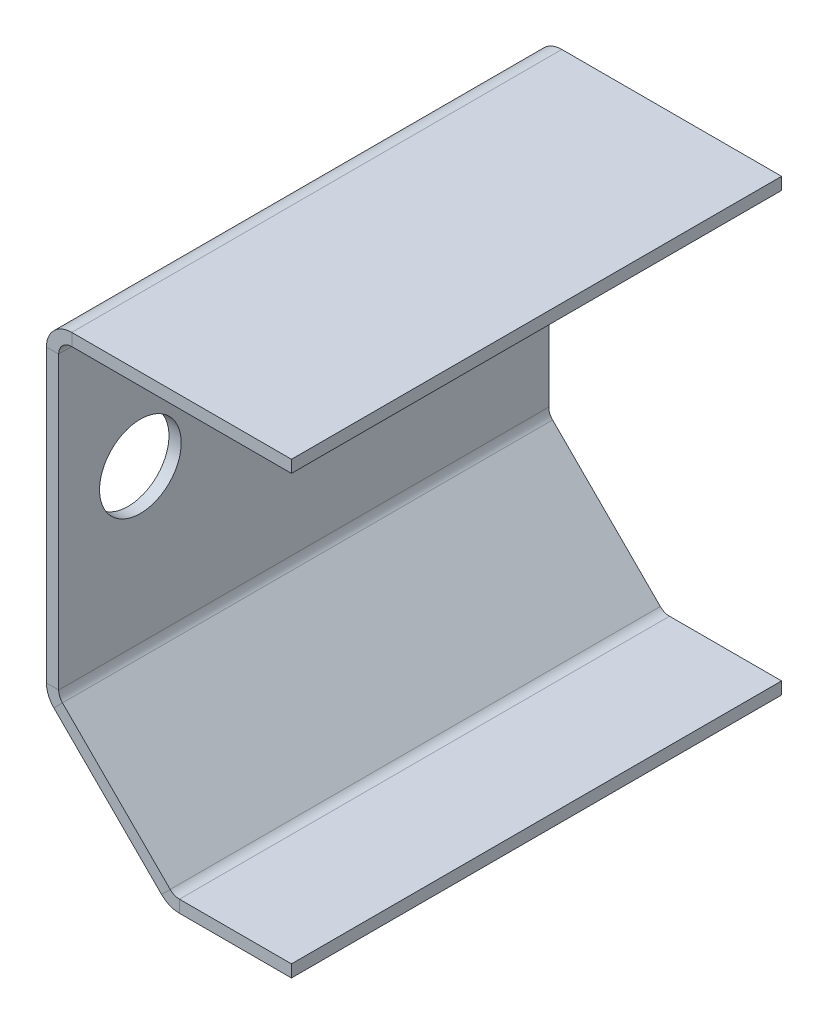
ISO-10303-21;
HEADER;
FILE_DESCRIPTION(('STEP AP214'),'2;1');
FILE_NAME('part.step','',(''),(''),'','','');
FILE_SCHEMA(('AUTOMOTIVE_DESIGN { 1 0 10303 214 1 1 1 1 }'));
ENDSEC;
DATA;
#1=APPLICATION_CONTEXT('core data for automotive mechanical design processes');
#2=APPLICATION_PROTOCOL_DEFINITION('international standard','automotive_design',2000,#1);
#3=PRODUCT_CONTEXT('',#1,'mechanical');
#4=PRODUCT('Part','Part','',(#3));
#5=PRODUCT_RELATED_PRODUCT_CATEGORY('part','',(#4));
#6=PRODUCT_DEFINITION_FORMATION('','',#4);
#7=PRODUCT_DEFINITION_CONTEXT('part definition',#1,'design');
#8=PRODUCT_DEFINITION('design','',#6,#7);
#9=PRODUCT_DEFINITION_SHAPE('','',#8);
#10=(LENGTH_UNIT() NAMED_UNIT(*) SI_UNIT(.MILLI.,.METRE.));
#11=(NAMED_UNIT(*) PLANE_ANGLE_UNIT() SI_UNIT($,.RADIAN.));
#12=(NAMED_UNIT(*) SI_UNIT($,.STERADIAN.) SOLID_ANGLE_UNIT());
#13=UNCERTAINTY_MEASURE_WITH_UNIT(LENGTH_MEASURE(1.E-05),#10,'distance_accuracy_value','');
#14=(GEOMETRIC_REPRESENTATION_CONTEXT(3) GLOBAL_UNCERTAINTY_ASSIGNED_CONTEXT((#13)) GLOBAL_UNIT_ASSIGNED_CONTEXT((#10,
#11,#12)) REPRESENTATION_CONTEXT('',''));
#15=CARTESIAN_POINT('',(0.,0.,0.));
#16=DIRECTION('',(0.,0.,1.));
#17=DIRECTION('',(1.,0.,0.));
#18=AXIS2_PLACEMENT_3D('',#15,#16,#17);
#19=CARTESIAN_POINT('',(-21.9,-3.7159379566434,60.));
#20=DIRECTION('',(0.,0.,1.));
#21=DIRECTION('',(1.,0.,0.));
#22=AXIS2_PLACEMENT_3D('',#19,#20,#21);
#23=PLANE('',#22);
#24=DIRECTION('',(-0.707106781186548,-0.707106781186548,0.));
#25=VECTOR('',#24,1.);
#26=CARTESIAN_POINT('',(-24.0920310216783,-5.9079689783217,60.));
#27=LINE('',#26,#25);
#28=CARTESIAN_POINT('',(-23.0313708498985,-4.84730880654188,60.));
#29=VERTEX_POINT('',#28);
#30=CARTESIAN_POINT('',(-24.0920310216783,-5.9079689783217,60.));
#31=VERTEX_POINT('',#30);
#32=EDGE_CURVE('E13',#29,#31,#27,.T.);
#33=ORIENTED_EDGE('',*,*,#32,.F.);
#34=CARTESIAN_POINT('',(-21.9,-3.7159379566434,60.));
#35=DIRECTION('',(0.,0.,-1.));
#36=DIRECTION('',(-1.,0.,0.));
#37=AXIS2_PLACEMENT_3D('',#34,#35,#36);
#38=CIRCLE('',#37,1.6);
#39=CARTESIAN_POINT('',(-23.5,-3.7159379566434,60.));
#40=VERTEX_POINT('',#39);
#41=EDGE_CURVE('E189',#40,#29,#38,.F.);
#42=ORIENTED_EDGE('',*,*,#41,.F.);
#43=DIRECTION('',(-1.,0.,0.));
#44=VECTOR('',#43,1.);
#45=CARTESIAN_POINT('',(-25.,-3.7159379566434,60.));
#46=LINE('',#45,#44);
#47=CARTESIAN_POINT('',(-25.,-3.7159379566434,60.));
#48=VERTEX_POINT('',#47);
#49=EDGE_CURVE('E63',#40,#48,#46,.T.);
#50=ORIENTED_EDGE('',*,*,#49,.T.);
#51=CARTESIAN_POINT('',(-21.9,-3.7159379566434,60.));
#52=DIRECTION('',(0.,0.,-1.));
#53=DIRECTION('',(-1.,0.,0.));
#54=AXIS2_PLACEMENT_3D('',#51,#52,#53);
#55=CIRCLE('',#54,3.1);
#56=EDGE_CURVE('E257',#48,#31,#55,.F.);
#57=ORIENTED_EDGE('',*,*,#56,.T.);
#58=EDGE_LOOP('',(#33,#42,#50,#57));
#59=FACE_BOUND('',#58,.T.);
#60=ADVANCED_FACE('F53',(#59),#23,.T.);
#61=CARTESIAN_POINT('',(-25.,-5.,60.));
#62=DIRECTION('',(0.,0.,1.));
#63=DIRECTION('',(0.,1.,0.));
#64=AXIS2_PLACEMENT_3D('',#61,#62,#63);
#65=PLANE('',#64);
#66=ORIENTED_EDGE('',*,*,#49,.F.);
#67=DIRECTION('',(0.,1.,0.));
#68=VECTOR('',#67,1.);
#69=CARTESIAN_POINT('',(-23.5,-5.,60.));
#70=LINE('',#69,#68);
#71=CARTESIAN_POINT('',(-23.5,31.9,60.));
#72=VERTEX_POINT('',#71);
#73=EDGE_CURVE('E210',#40,#72,#70,.T.);
#74=ORIENTED_EDGE('',*,*,#73,.T.);
#75=DIRECTION('',(-1.,0.,0.));
#76=VECTOR('',#75,1.);
#77=CARTESIAN_POINT('',(-25.,31.9,60.));
#78=LINE('',#77,#76);
#79=CARTESIAN_POINT('',(-25.,31.9,60.));
#80=VERTEX_POINT('',#79);
#81=EDGE_CURVE('E250',#72,#80,#78,.T.);
#82=ORIENTED_EDGE('',*,*,#81,.T.);
#83=DIRECTION('',(0.,1.,0.));
#84=VECTOR('',#83,1.);
#85=CARTESIAN_POINT('',(-25.,-5.,60.));
#86=LINE('',#85,#84);
#87=EDGE_CURVE('E276',#48,#80,#86,.T.);
#88=ORIENTED_EDGE('',*,*,#87,.F.);
#89=EDGE_LOOP('',(#66,#74,#82,#88));
#90=FACE_BOUND('',#89,.T.);
#91=ADVANCED_FACE('F277',(#90),#65,.T.);
#92=CARTESIAN_POINT('',(-21.9,31.9,60.));
#93=DIRECTION('',(0.,0.,1.));
#94=DIRECTION('',(1.,0.,0.));
#95=AXIS2_PLACEMENT_3D('',#92,#93,#94);
#96=PLANE('',#95);
#97=ORIENTED_EDGE('',*,*,#81,.F.);
#98=CARTESIAN_POINT('',(-21.9,31.9,60.));
#99=DIRECTION('',(0.,0.,-1.));
#100=DIRECTION('',(-1.,0.,0.));
#101=AXIS2_PLACEMENT_3D('',#98,#99,#100);
#102=CIRCLE('',#101,1.6);
#103=CARTESIAN_POINT('',(-21.9,33.5,60.));
#104=VERTEX_POINT('',#103);
#105=EDGE_CURVE('E197',#104,#72,#102,.F.);
#106=ORIENTED_EDGE('',*,*,#105,.F.);
#107=DIRECTION('',(0.,1.,0.));
#108=VECTOR('',#107,1.);
#109=CARTESIAN_POINT('',(-21.9,35.,60.));
#110=LINE('',#109,#108);
#111=CARTESIAN_POINT('',(-21.9,35.,60.));
#112=VERTEX_POINT('',#111);
#113=EDGE_CURVE('E247',#104,#112,#110,.T.);
#114=ORIENTED_EDGE('',*,*,#113,.T.);
#115=CARTESIAN_POINT('',(-21.9,31.9,60.));
#116=DIRECTION('',(0.,0.,-1.));
#117=DIRECTION('',(-1.,0.,0.));
#118=AXIS2_PLACEMENT_3D('',#115,#116,#117);
#119=CIRCLE('',#118,3.1);
#120=EDGE_CURVE('E290',#112,#80,#119,.F.);
#121=ORIENTED_EDGE('',*,*,#120,.T.);
#122=EDGE_LOOP('',(#97,#106,#114,#121));
#123=FACE_BOUND('',#122,.T.);
#124=ADVANCED_FACE('F353',(#123),#96,.T.);
#125=CARTESIAN_POINT('',(-25.,35.,60.));
#126=DIRECTION('',(0.,0.,1.));
#127=DIRECTION('',(1.,0.,0.));
#128=AXIS2_PLACEMENT_3D('',#125,#126,#127);
#129=PLANE('',#128);
#130=ORIENTED_EDGE('',*,*,#113,.F.);
#131=DIRECTION('',(1.,0.,0.));
#132=VECTOR('',#131,1.);
#133=CARTESIAN_POINT('',(-25.,33.5,60.));
#134=LINE('',#133,#132);
#135=CARTESIAN_POINT('',(5.,33.5,60.));
#136=VERTEX_POINT('',#135);
#137=EDGE_CURVE('E205',#104,#136,#134,.T.);
#138=ORIENTED_EDGE('',*,*,#137,.T.);
#139=DIRECTION('',(0.,1.,0.));
#140=VECTOR('',#139,1.);
#141=CARTESIAN_POINT('',(5.,35.,60.));
#142=LINE('',#141,#140);
#143=CARTESIAN_POINT('',(5.,35.,60.));
#144=VERTEX_POINT('',#143);
#145=EDGE_CURVE('E244',#136,#144,#142,.T.);
#146=ORIENTED_EDGE('',*,*,#145,.T.);
#147=DIRECTION('',(1.,0.,0.));
#148=VECTOR('',#147,1.);
#149=CARTESIAN_POINT('',(-25.,35.,60.));
#150=LINE('',#149,#148);
#151=EDGE_CURVE('E371',#112,#144,#150,.T.);
#152=ORIENTED_EDGE('',*,*,#151,.F.);
#153=EDGE_LOOP('',(#130,#138,#146,#152));
#154=FACE_BOUND('',#153,.T.);
#155=ADVANCED_FACE('F723',(#154),#129,.T.);
#156=CARTESIAN_POINT('',(5.,35.,60.));
#157=DIRECTION('',(1.,0.,0.));
#158=DIRECTION('',(0.,0.,-1.));
#159=AXIS2_PLACEMENT_3D('',#156,#157,#158);
#160=PLANE('',#159);
#161=ORIENTED_EDGE('',*,*,#145,.F.);
#162=DIRECTION('',(0.,0.,1.));
#163=VECTOR('',#162,1.);
#164=CARTESIAN_POINT('',(5.,33.5,60.));
#165=LINE('',#164,#163);
#166=CARTESIAN_POINT('',(5.,33.5,0.));
#167=VERTEX_POINT('',#166);
#168=EDGE_CURVE('E201',#136,#167,#165,.F.);
#169=ORIENTED_EDGE('',*,*,#168,.T.);
#170=DIRECTION('',(0.,1.,0.));
#171=VECTOR('',#170,1.);
#172=CARTESIAN_POINT('',(5.,35.,0.));
#173=LINE('',#172,#171);
#174=CARTESIAN_POINT('',(5.,35.,0.));
#175=VERTEX_POINT('',#174);
#176=EDGE_CURVE('E241',#167,#175,#173,.T.);
#177=ORIENTED_EDGE('',*,*,#176,.T.);
#178=DIRECTION('',(0.,0.,-1.));
#179=VECTOR('',#178,1.);
#180=CARTESIAN_POINT('',(5.,35.,60.));
#181=LINE('',#180,#179);
#182=EDGE_CURVE('E368',#144,#175,#181,.T.);
#183=ORIENTED_EDGE('',*,*,#182,.F.);
#184=EDGE_LOOP('',(#161,#169,#177,#183));
#185=FACE_BOUND('',#184,.T.);
#186=ADVANCED_FACE('F712',(#185),#160,.T.);
#187=CARTESIAN_POINT('',(-25.,35.,0.));
#188=DIRECTION('',(0.,0.,1.));
#189=DIRECTION('',(1.,0.,0.));
#190=AXIS2_PLACEMENT_3D('',#187,#188,#189);
#191=PLANE('',#190);
#192=ORIENTED_EDGE('',*,*,#176,.F.);
#193=DIRECTION('',(1.,0.,0.));
#194=VECTOR('',#193,1.);
#195=CARTESIAN_POINT('',(-25.,33.5,0.));
#196=LINE('',#195,#194);
#197=CARTESIAN_POINT('',(-21.9,33.5,0.));
#198=VERTEX_POINT('',#197);
#199=EDGE_CURVE('E198',#198,#167,#196,.T.);
#200=ORIENTED_EDGE('',*,*,#199,.F.);
#201=DIRECTION('',(0.,1.,0.));
#202=VECTOR('',#201,1.);
#203=CARTESIAN_POINT('',(-21.9,35.,0.));
#204=LINE('',#203,#202);
#205=CARTESIAN_POINT('',(-21.9,35.,0.));
#206=VERTEX_POINT('',#205);
#207=EDGE_CURVE('E238',#198,#206,#204,.T.);
#208=ORIENTED_EDGE('',*,*,#207,.T.);
#209=DIRECTION('',(1.,0.,0.));
#210=VECTOR('',#209,1.);
#211=CARTESIAN_POINT('',(-25.,35.,0.));
#212=LINE('',#211,#210);
#213=EDGE_CURVE('E170',#206,#175,#212,.T.);
#214=ORIENTED_EDGE('',*,*,#213,.T.);
#215=EDGE_LOOP('',(#192,#200,#208,#214));
#216=FACE_BOUND('',#215,.T.);
#217=ADVANCED_FACE('F377',(#216),#191,.F.);
#218=CARTESIAN_POINT('',(-21.9,31.9,0.));
#219=DIRECTION('',(0.,0.,1.));
#220=DIRECTION('',(1.,0.,0.));
#221=AXIS2_PLACEMENT_3D('',#218,#219,#220);
#222=PLANE('',#221);
#223=ORIENTED_EDGE('',*,*,#207,.F.);
#224=CARTESIAN_POINT('',(-21.9,31.9,0.));
#225=DIRECTION('',(0.,0.,-1.));
#226=DIRECTION('',(-1.,0.,0.));
#227=AXIS2_PLACEMENT_3D('',#224,#225,#226);
#228=CIRCLE('',#227,1.6);
#229=CARTESIAN_POINT('',(-23.5,31.9,0.));
#230=VERTEX_POINT('',#229);
#231=EDGE_CURVE('E186',#230,#198,#228,.T.);
#232=ORIENTED_EDGE('',*,*,#231,.F.);
#233=DIRECTION('',(-1.,0.,0.));
#234=VECTOR('',#233,1.);
#235=CARTESIAN_POINT('',(-25.,31.9,0.));
#236=LINE('',#235,#234);
#237=CARTESIAN_POINT('',(-25.,31.9,0.));
#238=VERTEX_POINT('',#237);
#239=EDGE_CURVE('E235',#230,#238,#236,.T.);
#240=ORIENTED_EDGE('',*,*,#239,.T.);
#241=CARTESIAN_POINT('',(-21.9,31.9,0.));
#242=DIRECTION('',(0.,0.,-1.));
#243=DIRECTION('',(-1.,0.,0.));
#244=AXIS2_PLACEMENT_3D('',#241,#242,#243);
#245=CIRCLE('',#244,3.1);
#246=EDGE_CURVE('E292',#238,#206,#245,.T.);
#247=ORIENTED_EDGE('',*,*,#246,.T.);
#248=EDGE_LOOP('',(#223,#232,#240,#247));
#249=FACE_BOUND('',#248,.T.);
#250=ADVANCED_FACE('F339',(#249),#222,.F.);
#251=CARTESIAN_POINT('',(-25.,-5.,0.));
#252=DIRECTION('',(0.,0.,1.));
#253=DIRECTION('',(0.,1.,0.));
#254=AXIS2_PLACEMENT_3D('',#251,#252,#253);
#255=PLANE('',#254);
#256=ORIENTED_EDGE('',*,*,#239,.F.);
#257=DIRECTION('',(0.,1.,0.));
#258=VECTOR('',#257,1.);
#259=CARTESIAN_POINT('',(-23.5,-5.,0.));
#260=LINE('',#259,#258);
#261=CARTESIAN_POINT('',(-23.5,-3.7159379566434,0.));
#262=VERTEX_POINT('',#261);
#263=EDGE_CURVE('E190',#262,#230,#260,.T.);
#264=ORIENTED_EDGE('',*,*,#263,.F.);
#265=DIRECTION('',(-1.,0.,0.));
#266=VECTOR('',#265,1.);
#267=CARTESIAN_POINT('',(-25.,-3.7159379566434,0.));
#268=LINE('',#267,#266);
#269=CARTESIAN_POINT('',(-25.,-3.7159379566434,0.));
#270=VERTEX_POINT('',#269);
#271=EDGE_CURVE('E232',#262,#270,#268,.T.);
#272=ORIENTED_EDGE('',*,*,#271,.T.);
#273=DIRECTION('',(0.,1.,0.));
#274=VECTOR('',#273,1.);
#275=CARTESIAN_POINT('',(-25.,-5.,0.));
#276=LINE('',#275,#274);
#277=EDGE_CURVE('E288',#270,#238,#276,.T.);
#278=ORIENTED_EDGE('',*,*,#277,.T.);
#279=EDGE_LOOP('',(#256,#264,#272,#278));
#280=FACE_BOUND('',#279,.T.);
#281=ADVANCED_FACE('F680',(#280),#255,.F.);
#282=CARTESIAN_POINT('',(-21.9,-3.7159379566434,0.));
#283=DIRECTION('',(0.,0.,1.));
#284=DIRECTION('',(1.,0.,0.));
#285=AXIS2_PLACEMENT_3D('',#282,#283,#284);
#286=PLANE('',#285);
#287=ORIENTED_EDGE('',*,*,#271,.F.);
#288=CARTESIAN_POINT('',(-21.9,-3.7159379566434,0.));
#289=DIRECTION('',(0.,0.,-1.));
#290=DIRECTION('',(-1.,0.,0.));
#291=AXIS2_PLACEMENT_3D('',#288,#289,#290);
#292=CIRCLE('',#291,1.6);
#293=CARTESIAN_POINT('',(-23.0313708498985,-4.84730880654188,0.));
#294=VERTEX_POINT('',#293);
#295=EDGE_CURVE('E181',#294,#262,#292,.T.);
#296=ORIENTED_EDGE('',*,*,#295,.F.);
#297=DIRECTION('',(-0.707106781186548,-0.707106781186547,0.));
#298=VECTOR('',#297,1.);
#299=CARTESIAN_POINT('',(-24.0920310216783,-5.9079689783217,0.));
#300=LINE('',#299,#298);
#301=CARTESIAN_POINT('',(-24.0920310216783,-5.9079689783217,0.));
#302=VERTEX_POINT('',#301);
#303=EDGE_CURVE('E229',#294,#302,#300,.T.);
#304=ORIENTED_EDGE('',*,*,#303,.T.);
#305=CARTESIAN_POINT('',(-21.9,-3.7159379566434,0.));
#306=DIRECTION('',(0.,0.,-1.));
#307=DIRECTION('',(-1.,0.,0.));
#308=AXIS2_PLACEMENT_3D('',#305,#306,#307);
#309=CIRCLE('',#308,3.1);
#310=EDGE_CURVE('E273',#302,#270,#309,.T.);
#311=ORIENTED_EDGE('',*,*,#310,.T.);
#312=EDGE_LOOP('',(#287,#296,#304,#311));
#313=FACE_BOUND('',#312,.T.);
#314=ADVANCED_FACE('F668',(#313),#286,.F.);
#315=CARTESIAN_POINT('',(-10.,-20.,0.));
#316=DIRECTION('',(0.,0.,1.));
#317=DIRECTION('',(-0.707106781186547,0.707106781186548,0.));
#318=AXIS2_PLACEMENT_3D('',#315,#316,#317);
#319=PLANE('',#318);
#320=ORIENTED_EDGE('',*,*,#303,.F.);
#321=DIRECTION('',(0.707106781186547,-0.707106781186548,0.));
#322=VECTOR('',#321,1.);
#323=CARTESIAN_POINT('',(-8.93933982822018,-18.9393398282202,0.));
#324=LINE('',#323,#322);
#325=CARTESIAN_POINT('',(-9.84730880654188,-18.0313708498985,0.));
#326=VERTEX_POINT('',#325);
#327=EDGE_CURVE('E158',#326,#294,#324,.F.);
#328=ORIENTED_EDGE('',*,*,#327,.F.);
#329=DIRECTION('',(-0.707106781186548,-0.707106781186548,0.));
#330=VECTOR('',#329,1.);
#331=CARTESIAN_POINT('',(-10.9079689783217,-19.0920310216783,0.));
#332=LINE('',#331,#330);
#333=CARTESIAN_POINT('',(-10.9079689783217,-19.0920310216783,0.));
#334=VERTEX_POINT('',#333);
#335=EDGE_CURVE('E226',#326,#334,#332,.T.);
#336=ORIENTED_EDGE('',*,*,#335,.T.);
#337=DIRECTION('',(-0.707106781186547,0.707106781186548,0.));
#338=VECTOR('',#337,1.);
#339=CARTESIAN_POINT('',(-10.,-20.,0.));
#340=LINE('',#339,#338);
#341=EDGE_CURVE('E299',#334,#302,#340,.T.);
#342=ORIENTED_EDGE('',*,*,#341,.T.);
#343=EDGE_LOOP('',(#320,#328,#336,#342));
#344=FACE_BOUND('',#343,.T.);
#345=ADVANCED_FACE('F657',(#344),#319,.F.);
#346=CARTESIAN_POINT('',(-8.7159379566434,-16.9,0.));
#347=DIRECTION('',(0.,0.,1.));
#348=DIRECTION('',(1.,0.,0.));
#349=AXIS2_PLACEMENT_3D('',#346,#347,#348);
#350=PLANE('',#349);
#351=ORIENTED_EDGE('',*,*,#335,.F.);
#352=CARTESIAN_POINT('',(-8.7159379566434,-16.9,0.));
#353=DIRECTION('',(0.,0.,-1.));
#354=DIRECTION('',(-1.,0.,0.));
#355=AXIS2_PLACEMENT_3D('',#352,#353,#354);
#356=CIRCLE('',#355,1.6);
#357=CARTESIAN_POINT('',(-8.7159379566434,-18.5,0.));
#358=VERTEX_POINT('',#357);
#359=EDGE_CURVE('E154',#358,#326,#356,.T.);
#360=ORIENTED_EDGE('',*,*,#359,.F.);
#361=DIRECTION('',(0.,-1.,0.));
#362=VECTOR('',#361,1.);
#363=CARTESIAN_POINT('',(-8.7159379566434,-20.,0.));
#364=LINE('',#363,#362);
#365=CARTESIAN_POINT('',(-8.7159379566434,-20.,0.));
#366=VERTEX_POINT('',#365);
#367=EDGE_CURVE('E223',#358,#366,#364,.T.);
#368=ORIENTED_EDGE('',*,*,#367,.T.);
#369=CARTESIAN_POINT('',(-8.7159379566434,-16.9,0.));
#370=DIRECTION('',(0.,0.,-1.));
#371=DIRECTION('',(-1.,0.,0.));
#372=AXIS2_PLACEMENT_3D('',#369,#370,#371);
#373=CIRCLE('',#372,3.1);
#374=EDGE_CURVE('E143',#366,#334,#373,.T.);
#375=ORIENTED_EDGE('',*,*,#374,.T.);
#376=EDGE_LOOP('',(#351,#360,#368,#375));
#377=FACE_BOUND('',#376,.T.);
#378=ADVANCED_FACE('F396',(#377),#350,.F.);
#379=CARTESIAN_POINT('',(5.,-20.,0.));
#380=DIRECTION('',(0.,0.,1.));
#381=DIRECTION('',(-1.,0.,0.));
#382=AXIS2_PLACEMENT_3D('',#379,#380,#381);
#383=PLANE('',#382);
#384=ORIENTED_EDGE('',*,*,#367,.F.);
#385=DIRECTION('',(1.,0.,0.));
#386=VECTOR('',#385,1.);
#387=CARTESIAN_POINT('',(5.,-18.5,0.));
#388=LINE('',#387,#386);
#389=CARTESIAN_POINT('',(5.,-18.5,0.));
#390=VERTEX_POINT('',#389);
#391=EDGE_CURVE('E173',#390,#358,#388,.F.);
#392=ORIENTED_EDGE('',*,*,#391,.F.);
#393=DIRECTION('',(0.,-1.,0.));
#394=VECTOR('',#393,1.);
#395=CARTESIAN_POINT('',(5.,-20.,0.));
#396=LINE('',#395,#394);
#397=CARTESIAN_POINT('',(5.,-20.,0.));
#398=VERTEX_POINT('',#397);
#399=EDGE_CURVE('E221',#390,#398,#396,.T.);
#400=ORIENTED_EDGE('',*,*,#399,.T.);
#401=DIRECTION('',(-1.,0.,0.));
#402=VECTOR('',#401,1.);
#403=CARTESIAN_POINT('',(5.,-20.,0.));
#404=LINE('',#403,#402);
#405=EDGE_CURVE('E313',#398,#366,#404,.T.);
#406=ORIENTED_EDGE('',*,*,#405,.T.);
#407=EDGE_LOOP('',(#384,#392,#400,#406));
#408=FACE_BOUND('',#407,.T.);
#409=ADVANCED_FACE('F402',(#408),#383,.F.);
#410=CARTESIAN_POINT('',(5.,-20.,60.));
#411=DIRECTION('',(-1.,0.,0.));
#412=DIRECTION('',(0.,0.,-1.));
#413=AXIS2_PLACEMENT_3D('',#410,#411,#412);
#414=PLANE('',#413);
#415=ORIENTED_EDGE('',*,*,#399,.F.);
#416=DIRECTION('',(0.,0.,-1.));
#417=VECTOR('',#416,1.);
#418=CARTESIAN_POINT('',(5.,-18.5,60.));
#419=LINE('',#418,#417);
#420=CARTESIAN_POINT('',(5.,-18.5,60.));
#421=VERTEX_POINT('',#420);
#422=EDGE_CURVE('E168',#421,#390,#419,.T.);
#423=ORIENTED_EDGE('',*,*,#422,.F.);
#424=DIRECTION('',(0.,-1.,0.));
#425=VECTOR('',#424,1.);
#426=CARTESIAN_POINT('',(5.,-20.,60.));
#427=LINE('',#426,#425);
#428=CARTESIAN_POINT('',(5.,-20.,60.));
#429=VERTEX_POINT('',#428);
#430=EDGE_CURVE('E71',#421,#429,#427,.T.);
#431=ORIENTED_EDGE('',*,*,#430,.T.);
#432=DIRECTION('',(0.,0.,-1.));
#433=VECTOR('',#432,1.);
#434=CARTESIAN_POINT('',(5.,-20.,60.));
#435=LINE('',#434,#433);
#436=EDGE_CURVE('E316',#429,#398,#435,.T.);
#437=ORIENTED_EDGE('',*,*,#436,.T.);
#438=EDGE_LOOP('',(#415,#423,#431,#437));
#439=FACE_BOUND('',#438,.T.);
#440=ADVANCED_FACE('F414',(#439),#414,.F.);
#441=CARTESIAN_POINT('',(5.,-20.,60.));
#442=DIRECTION('',(0.,0.,1.));
#443=DIRECTION('',(-1.,0.,0.));
#444=AXIS2_PLACEMENT_3D('',#441,#442,#443);
#445=PLANE('',#444);
#446=ORIENTED_EDGE('',*,*,#430,.F.);
#447=DIRECTION('',(1.,0.,0.));
#448=VECTOR('',#447,1.);
#449=CARTESIAN_POINT('',(5.,-18.5,60.));
#450=LINE('',#449,#448);
#451=CARTESIAN_POINT('',(-8.7159379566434,-18.5,60.));
#452=VERTEX_POINT('',#451);
#453=EDGE_CURVE('E179',#421,#452,#450,.F.);
#454=ORIENTED_EDGE('',*,*,#453,.T.);
#455=DIRECTION('',(0.,-1.,0.));
#456=VECTOR('',#455,1.);
#457=CARTESIAN_POINT('',(-8.7159379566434,-20.,60.));
#458=LINE('',#457,#456);
#459=CARTESIAN_POINT('',(-8.7159379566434,-20.,60.));
#460=VERTEX_POINT('',#459);
#461=EDGE_CURVE('E142',#452,#460,#458,.T.);
#462=ORIENTED_EDGE('',*,*,#461,.T.);
#463=DIRECTION('',(-1.,0.,0.));
#464=VECTOR('',#463,1.);
#465=CARTESIAN_POINT('',(5.,-20.,60.));
#466=LINE('',#465,#464);
#467=EDGE_CURVE('E307',#429,#460,#466,.T.);
#468=ORIENTED_EDGE('',*,*,#467,.F.);
#469=EDGE_LOOP('',(#446,#454,#462,#468));
#470=FACE_BOUND('',#469,.T.);
#471=ADVANCED_FACE('F410',(#470),#445,.T.);
#472=CARTESIAN_POINT('',(-8.7159379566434,-16.9,60.));
#473=DIRECTION('',(0.,0.,1.));
#474=DIRECTION('',(1.,0.,0.));
#475=AXIS2_PLACEMENT_3D('',#472,#473,#474);
#476=PLANE('',#475);
#477=ORIENTED_EDGE('',*,*,#461,.F.);
#478=CARTESIAN_POINT('',(-8.7159379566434,-16.9,60.));
#479=DIRECTION('',(0.,0.,-1.));
#480=DIRECTION('',(-1.,0.,0.));
#481=AXIS2_PLACEMENT_3D('',#478,#479,#480);
#482=CIRCLE('',#481,1.6);
#483=CARTESIAN_POINT('',(-9.84730880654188,-18.0313708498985,60.));
#484=VERTEX_POINT('',#483);
#485=EDGE_CURVE('E151',#484,#452,#482,.F.);
#486=ORIENTED_EDGE('',*,*,#485,.F.);
#487=DIRECTION('',(-0.707106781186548,-0.707106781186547,0.));
#488=VECTOR('',#487,1.);
#489=CARTESIAN_POINT('',(-10.9079689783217,-19.0920310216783,60.));
#490=LINE('',#489,#488);
#491=CARTESIAN_POINT('',(-10.9079689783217,-19.0920310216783,60.));
#492=VERTEX_POINT('',#491);
#493=EDGE_CURVE('E57',#484,#492,#490,.T.);
#494=ORIENTED_EDGE('',*,*,#493,.T.);
#495=CARTESIAN_POINT('',(-8.7159379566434,-16.9,60.));
#496=DIRECTION('',(0.,0.,-1.));
#497=DIRECTION('',(-1.,0.,0.));
#498=AXIS2_PLACEMENT_3D('',#495,#496,#497);
#499=CIRCLE('',#498,3.1);
#500=EDGE_CURVE('E318',#492,#460,#499,.F.);
#501=ORIENTED_EDGE('',*,*,#500,.T.);
#502=EDGE_LOOP('',(#477,#486,#494,#501));
#503=FACE_BOUND('',#502,.T.);
#504=ADVANCED_FACE('F165',(#503),#476,.T.);
#505=CARTESIAN_POINT('',(-25.,15.,50.));
#506=DIRECTION('',(-1.,0.,0.));
#507=DIRECTION('',(0.,0.,1.));
#508=AXIS2_PLACEMENT_3D('',#505,#506,#507);
#509=CYLINDRICAL_SURFACE('',#508,5.);
#510=CARTESIAN_POINT('',(-25.,15.,50.));
#511=DIRECTION('',(-1.,0.,0.));
#512=DIRECTION('',(0.,0.,1.));
#513=AXIS2_PLACEMENT_3D('',#510,#511,#512);
#514=CIRCLE('',#513,5.);
#515=CARTESIAN_POINT('',(-25.,15.,55.));
#516=VERTEX_POINT('',#515);
#517=EDGE_CURVE('E365',#516,#516,#514,.T.);
#518=ORIENTED_EDGE('',*,*,#517,.T.);
#519=EDGE_LOOP('',(#518));
#520=FACE_BOUND('',#519,.T.);
#521=CARTESIAN_POINT('',(-23.5,15.,50.));
#522=DIRECTION('',(-1.,0.,0.));
#523=DIRECTION('',(0.,0.,1.));
#524=AXIS2_PLACEMENT_3D('',#521,#522,#523);
#525=CIRCLE('',#524,5.);
#526=CARTESIAN_POINT('',(-23.5,15.,55.));
#527=VERTEX_POINT('',#526);
#528=EDGE_CURVE('E204',#527,#527,#525,.T.);
#529=ORIENTED_EDGE('',*,*,#528,.F.);
#530=EDGE_LOOP('',(#529));
#531=FACE_BOUND('',#530,.T.);
#532=ADVANCED_FACE('F432',(#520,#531),#509,.F.);
#533=CARTESIAN_POINT('',(-25.,15.,10.));
#534=DIRECTION('',(-1.,0.,0.));
#535=DIRECTION('',(0.,0.,1.));
#536=AXIS2_PLACEMENT_3D('',#533,#534,#535);
#537=CYLINDRICAL_SURFACE('',#536,5.);
#538=CARTESIAN_POINT('',(-25.,15.,10.));
#539=DIRECTION('',(-1.,0.,0.));
#540=DIRECTION('',(0.,0.,-1.));
#541=AXIS2_PLACEMENT_3D('',#538,#539,#540);
#542=CIRCLE('',#541,5.);
#543=CARTESIAN_POINT('',(-25.,15.,5.));
#544=VERTEX_POINT('',#543);
#545=EDGE_CURVE('E283',#544,#544,#542,.T.);
#546=ORIENTED_EDGE('',*,*,#545,.T.);
#547=EDGE_LOOP('',(#546));
#548=FACE_BOUND('',#547,.T.);
#549=CARTESIAN_POINT('',(-23.5,15.,10.));
#550=DIRECTION('',(-1.,0.,0.));
#551=DIRECTION('',(0.,0.,1.));
#552=AXIS2_PLACEMENT_3D('',#549,#550,#551);
#553=CIRCLE('',#552,5.);
#554=CARTESIAN_POINT('',(-23.5,15.,15.));
#555=VERTEX_POINT('',#554);
#556=EDGE_CURVE('E213',#555,#555,#553,.T.);
#557=ORIENTED_EDGE('',*,*,#556,.F.);
#558=EDGE_LOOP('',(#557));
#559=FACE_BOUND('',#558,.T.);
#560=ADVANCED_FACE('F55',(#548,#559),#537,.F.);
#561=CARTESIAN_POINT('',(-10.,-20.,60.));
#562=DIRECTION('',(0.,0.,1.));
#563=DIRECTION('',(-0.707106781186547,0.707106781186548,0.));
#564=AXIS2_PLACEMENT_3D('',#561,#562,#563);
#565=PLANE('',#564);
#566=DIRECTION('',(0.707106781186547,-0.707106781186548,0.));
#567=VECTOR('',#566,1.);
#568=CARTESIAN_POINT('',(-8.93933982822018,-18.9393398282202,60.));
#569=LINE('',#568,#567);
#570=EDGE_CURVE('E133',#484,#29,#569,.F.);
#571=ORIENTED_EDGE('',*,*,#570,.T.);
#572=ORIENTED_EDGE('',*,*,#32,.T.);
#573=DIRECTION('',(-0.707106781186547,0.707106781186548,0.));
#574=VECTOR('',#573,1.);
#575=CARTESIAN_POINT('',(-10.,-20.,60.));
#576=LINE('',#575,#574);
#577=EDGE_CURVE('E136',#492,#31,#576,.T.);
#578=ORIENTED_EDGE('',*,*,#577,.F.);
#579=ORIENTED_EDGE('',*,*,#493,.F.);
#580=EDGE_LOOP('',(#571,#572,#578,#579));
#581=FACE_BOUND('',#580,.T.);
#582=ADVANCED_FACE('F131',(#581),#565,.T.);
#583=CARTESIAN_POINT('',(-8.7159379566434,-16.9,60.));
#584=DIRECTION('',(0.,0.,-1.));
#585=DIRECTION('',(-1.,0.,0.));
#586=AXIS2_PLACEMENT_3D('',#583,#584,#585);
#587=CYLINDRICAL_SURFACE('',#586,3.1);
#588=ORIENTED_EDGE('',*,*,#500,.F.);
#589=DIRECTION('',(0.,0.,-1.));
#590=VECTOR('',#589,1.);
#591=CARTESIAN_POINT('',(-10.9079689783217,-19.0920310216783,60.));
#592=LINE('',#591,#590);
#593=EDGE_CURVE('E302',#334,#492,#592,.F.);
#594=ORIENTED_EDGE('',*,*,#593,.F.);
#595=ORIENTED_EDGE('',*,*,#374,.F.);
#596=DIRECTION('',(0.,0.,-1.));
#597=VECTOR('',#596,1.);
#598=CARTESIAN_POINT('',(-8.7159379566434,-20.,60.));
#599=LINE('',#598,#597);
#600=EDGE_CURVE('E310',#460,#366,#599,.T.);
#601=ORIENTED_EDGE('',*,*,#600,.F.);
#602=EDGE_LOOP('',(#588,#594,#595,#601));
#603=FACE_BOUND('',#602,.T.);
#604=ADVANCED_FACE('F406',(#603),#587,.T.);
#605=CARTESIAN_POINT('',(5.,-20.,60.));
#606=DIRECTION('',(0.,-1.,0.));
#607=DIRECTION('',(0.,0.,-1.));
#608=AXIS2_PLACEMENT_3D('',#605,#606,#607);
#609=PLANE('',#608);
#610=ORIENTED_EDGE('',*,*,#467,.T.);
#611=ORIENTED_EDGE('',*,*,#600,.T.);
#612=ORIENTED_EDGE('',*,*,#405,.F.);
#613=ORIENTED_EDGE('',*,*,#436,.F.);
#614=EDGE_LOOP('',(#610,#611,#612,#613));
#615=FACE_BOUND('',#614,.T.);
#616=ADVANCED_FACE('F407',(#615),#609,.T.);
#617=CARTESIAN_POINT('',(-21.9,-3.7159379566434,60.));
#618=DIRECTION('',(0.,0.,-1.));
#619=DIRECTION('',(-1.,0.,0.));
#620=AXIS2_PLACEMENT_3D('',#617,#618,#619);
#621=CYLINDRICAL_SURFACE('',#620,3.1);
#622=ORIENTED_EDGE('',*,*,#56,.F.);
#623=DIRECTION('',(0.,0.,-1.));
#624=VECTOR('',#623,1.);
#625=CARTESIAN_POINT('',(-25.,-3.7159379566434,60.));
#626=LINE('',#625,#624);
#627=EDGE_CURVE('E270',#270,#48,#626,.F.);
#628=ORIENTED_EDGE('',*,*,#627,.F.);
#629=ORIENTED_EDGE('',*,*,#310,.F.);
#630=DIRECTION('',(0.,0.,-1.));
#631=VECTOR('',#630,1.);
#632=CARTESIAN_POINT('',(-24.0920310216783,-5.9079689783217,60.));
#633=LINE('',#632,#631);
#634=EDGE_CURVE('E272',#31,#302,#633,.T.);
#635=ORIENTED_EDGE('',*,*,#634,.F.);
#636=EDGE_LOOP('',(#622,#628,#629,#635));
#637=FACE_BOUND('',#636,.T.);
#638=ADVANCED_FACE('F267',(#637),#621,.T.);
#639=CARTESIAN_POINT('',(-10.,-20.,60.));
#640=DIRECTION('',(-0.707106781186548,-0.707106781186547,0.));
#641=DIRECTION('',(0.707106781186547,-0.707106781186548,0.));
#642=AXIS2_PLACEMENT_3D('',#639,#640,#641);
#643=PLANE('',#642);
#644=ORIENTED_EDGE('',*,*,#341,.F.);
#645=ORIENTED_EDGE('',*,*,#593,.T.);
#646=ORIENTED_EDGE('',*,*,#577,.T.);
#647=ORIENTED_EDGE('',*,*,#634,.T.);
#648=EDGE_LOOP('',(#644,#645,#646,#647));
#649=FACE_BOUND('',#648,.T.);
#650=ADVANCED_FACE('F473',(#649),#643,.T.);
#651=CARTESIAN_POINT('',(-21.9,31.9,60.));
#652=DIRECTION('',(0.,0.,-1.));
#653=DIRECTION('',(-1.,0.,0.));
#654=AXIS2_PLACEMENT_3D('',#651,#652,#653);
#655=CYLINDRICAL_SURFACE('',#654,3.1);
#656=ORIENTED_EDGE('',*,*,#120,.F.);
#657=DIRECTION('',(0.,0.,-1.));
#658=VECTOR('',#657,1.);
#659=CARTESIAN_POINT('',(-21.9,35.,60.));
#660=LINE('',#659,#658);
#661=EDGE_CURVE('E374',#206,#112,#660,.F.);
#662=ORIENTED_EDGE('',*,*,#661,.F.);
#663=ORIENTED_EDGE('',*,*,#246,.F.);
#664=DIRECTION('',(0.,0.,-1.));
#665=VECTOR('',#664,1.);
#666=CARTESIAN_POINT('',(-25.,31.9,60.));
#667=LINE('',#666,#665);
#668=EDGE_CURVE('E282',#80,#238,#667,.T.);
#669=ORIENTED_EDGE('',*,*,#668,.F.);
#670=EDGE_LOOP('',(#656,#662,#663,#669));
#671=FACE_BOUND('',#670,.T.);
#672=ADVANCED_FACE('F361',(#671),#655,.T.);
#673=CARTESIAN_POINT('',(-25.,-5.,60.));
#674=DIRECTION('',(-1.,0.,0.));
#675=DIRECTION('',(0.,0.,1.));
#676=AXIS2_PLACEMENT_3D('',#673,#674,#675);
#677=PLANE('',#676);
#678=ORIENTED_EDGE('',*,*,#517,.F.);
#679=EDGE_LOOP('',(#678));
#680=FACE_BOUND('',#679,.T.);
#681=ORIENTED_EDGE('',*,*,#545,.F.);
#682=EDGE_LOOP('',(#681));
#683=FACE_BOUND('',#682,.T.);
#684=ORIENTED_EDGE('',*,*,#87,.T.);
#685=ORIENTED_EDGE('',*,*,#668,.T.);
#686=ORIENTED_EDGE('',*,*,#277,.F.);
#687=ORIENTED_EDGE('',*,*,#627,.T.);
#688=EDGE_LOOP('',(#684,#685,#686,#687));
#689=FACE_BOUND('',#688,.T.);
#690=ADVANCED_FACE('F286',(#680,#683,#689),#677,.T.);
#691=CARTESIAN_POINT('',(-25.,35.,60.));
#692=DIRECTION('',(0.,1.,0.));
#693=DIRECTION('',(0.,0.,1.));
#694=AXIS2_PLACEMENT_3D('',#691,#692,#693);
#695=PLANE('',#694);
#696=ORIENTED_EDGE('',*,*,#213,.F.);
#697=ORIENTED_EDGE('',*,*,#661,.T.);
#698=ORIENTED_EDGE('',*,*,#151,.T.);
#699=ORIENTED_EDGE('',*,*,#182,.T.);
#700=EDGE_LOOP('',(#696,#697,#698,#699));
#701=FACE_BOUND('',#700,.T.);
#702=ADVANCED_FACE('F381',(#701),#695,.T.);
#703=CARTESIAN_POINT('',(-8.7159379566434,-16.9,60.));
#704=DIRECTION('',(0.,0.,-1.));
#705=DIRECTION('',(-1.,0.,0.));
#706=AXIS2_PLACEMENT_3D('',#703,#704,#705);
#707=CYLINDRICAL_SURFACE('',#706,1.6);
#708=ORIENTED_EDGE('',*,*,#485,.T.);
#709=DIRECTION('',(0.,0.,-1.));
#710=VECTOR('',#709,1.);
#711=CARTESIAN_POINT('',(-8.7159379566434,-18.5,60.));
#712=LINE('',#711,#710);
#713=EDGE_CURVE('E180',#452,#358,#712,.T.);
#714=ORIENTED_EDGE('',*,*,#713,.T.);
#715=ORIENTED_EDGE('',*,*,#359,.T.);
#716=DIRECTION('',(0.,0.,1.));
#717=VECTOR('',#716,1.);
#718=CARTESIAN_POINT('',(-9.84730880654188,-18.0313708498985,60.));
#719=LINE('',#718,#717);
#720=EDGE_CURVE('E148',#326,#484,#719,.T.);
#721=ORIENTED_EDGE('',*,*,#720,.T.);
#722=EDGE_LOOP('',(#708,#714,#715,#721));
#723=FACE_BOUND('',#722,.T.);
#724=ADVANCED_FACE('F149',(#723),#707,.F.);
#725=CARTESIAN_POINT('',(5.,-18.5,60.));
#726=DIRECTION('',(0.,-1.,0.));
#727=DIRECTION('',(0.,0.,-1.));
#728=AXIS2_PLACEMENT_3D('',#725,#726,#727);
#729=PLANE('',#728);
#730=ORIENTED_EDGE('',*,*,#453,.F.);
#731=ORIENTED_EDGE('',*,*,#422,.T.);
#732=ORIENTED_EDGE('',*,*,#391,.T.);
#733=ORIENTED_EDGE('',*,*,#713,.F.);
#734=EDGE_LOOP('',(#730,#731,#732,#733));
#735=FACE_BOUND('',#734,.T.);
#736=ADVANCED_FACE('F413',(#735),#729,.F.);
#737=CARTESIAN_POINT('',(-21.9,-3.7159379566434,60.));
#738=DIRECTION('',(0.,0.,-1.));
#739=DIRECTION('',(-1.,0.,0.));
#740=AXIS2_PLACEMENT_3D('',#737,#738,#739);
#741=CYLINDRICAL_SURFACE('',#740,1.6);
#742=ORIENTED_EDGE('',*,*,#41,.T.);
#743=DIRECTION('',(0.,0.,1.));
#744=VECTOR('',#743,1.);
#745=CARTESIAN_POINT('',(-23.0313708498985,-4.84730880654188,60.));
#746=LINE('',#745,#744);
#747=EDGE_CURVE('E162',#29,#294,#746,.F.);
#748=ORIENTED_EDGE('',*,*,#747,.T.);
#749=ORIENTED_EDGE('',*,*,#295,.T.);
#750=DIRECTION('',(0.,0.,1.));
#751=VECTOR('',#750,1.);
#752=CARTESIAN_POINT('',(-23.5,-3.7159379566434,60.));
#753=LINE('',#752,#751);
#754=EDGE_CURVE('E193',#262,#40,#753,.T.);
#755=ORIENTED_EDGE('',*,*,#754,.T.);
#756=EDGE_LOOP('',(#742,#748,#749,#755));
#757=FACE_BOUND('',#756,.T.);
#758=ADVANCED_FACE('F459',(#757),#741,.F.);
#759=CARTESIAN_POINT('',(-8.93933982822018,-18.9393398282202,60.));
#760=DIRECTION('',(-0.707106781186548,-0.707106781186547,0.));
#761=DIRECTION('',(0.707106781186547,-0.707106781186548,0.));
#762=AXIS2_PLACEMENT_3D('',#759,#760,#761);
#763=PLANE('',#762);
#764=ORIENTED_EDGE('',*,*,#327,.T.);
#765=ORIENTED_EDGE('',*,*,#747,.F.);
#766=ORIENTED_EDGE('',*,*,#570,.F.);
#767=ORIENTED_EDGE('',*,*,#720,.F.);
#768=EDGE_LOOP('',(#764,#765,#766,#767));
#769=FACE_BOUND('',#768,.T.);
#770=ADVANCED_FACE('F160',(#769),#763,.F.);
#771=CARTESIAN_POINT('',(-21.9,31.9,60.));
#772=DIRECTION('',(0.,0.,-1.));
#773=DIRECTION('',(-1.,0.,0.));
#774=AXIS2_PLACEMENT_3D('',#771,#772,#773);
#775=CYLINDRICAL_SURFACE('',#774,1.6);
#776=ORIENTED_EDGE('',*,*,#105,.T.);
#777=DIRECTION('',(0.,0.,1.));
#778=VECTOR('',#777,1.);
#779=CARTESIAN_POINT('',(-23.5,31.9,60.));
#780=LINE('',#779,#778);
#781=EDGE_CURVE('E194',#72,#230,#780,.F.);
#782=ORIENTED_EDGE('',*,*,#781,.T.);
#783=ORIENTED_EDGE('',*,*,#231,.T.);
#784=DIRECTION('',(0.,0.,1.));
#785=VECTOR('',#784,1.);
#786=CARTESIAN_POINT('',(-21.9,33.5,60.));
#787=LINE('',#786,#785);
#788=EDGE_CURVE('E177',#198,#104,#787,.T.);
#789=ORIENTED_EDGE('',*,*,#788,.T.);
#790=EDGE_LOOP('',(#776,#782,#783,#789));
#791=FACE_BOUND('',#790,.T.);
#792=ADVANCED_FACE('F327',(#791),#775,.F.);
#793=CARTESIAN_POINT('',(-23.5,-5.,60.));
#794=DIRECTION('',(-1.,0.,0.));
#795=DIRECTION('',(0.,0.,1.));
#796=AXIS2_PLACEMENT_3D('',#793,#794,#795);
#797=PLANE('',#796);
#798=ORIENTED_EDGE('',*,*,#528,.T.);
#799=EDGE_LOOP('',(#798));
#800=FACE_BOUND('',#799,.T.);
#801=ORIENTED_EDGE('',*,*,#556,.T.);
#802=EDGE_LOOP('',(#801));
#803=FACE_BOUND('',#802,.T.);
#804=ORIENTED_EDGE('',*,*,#73,.F.);
#805=ORIENTED_EDGE('',*,*,#754,.F.);
#806=ORIENTED_EDGE('',*,*,#263,.T.);
#807=ORIENTED_EDGE('',*,*,#781,.F.);
#808=EDGE_LOOP('',(#804,#805,#806,#807));
#809=FACE_BOUND('',#808,.T.);
#810=ADVANCED_FACE('F336',(#800,#803,#809),#797,.F.);
#811=CARTESIAN_POINT('',(-25.,33.5,60.));
#812=DIRECTION('',(0.,1.,0.));
#813=DIRECTION('',(0.,0.,1.));
#814=AXIS2_PLACEMENT_3D('',#811,#812,#813);
#815=PLANE('',#814);
#816=ORIENTED_EDGE('',*,*,#199,.T.);
#817=ORIENTED_EDGE('',*,*,#168,.F.);
#818=ORIENTED_EDGE('',*,*,#137,.F.);
#819=ORIENTED_EDGE('',*,*,#788,.F.);
#820=EDGE_LOOP('',(#816,#817,#818,#819));
#821=FACE_BOUND('',#820,.T.);
#822=ADVANCED_FACE('F349',(#821),#815,.F.);
#823=CLOSED_SHELL('',(#60,#91,#124,#155,#186,#217,#250,#281,#314,#345,#378,#409,#440,#471,#504,
#532,#560,#582,#604,#616,#638,#650,#672,#690,#702,#724,#736,#758,#770,#792,#810,#822));
#824=MANIFOLD_SOLID_BREP('B2',#823);
#825=ADVANCED_BREP_SHAPE_REPRESENTATION('',(#18,#824),#14);
#826=SHAPE_DEFINITION_REPRESENTATION(#9,#825);
ENDSEC;
END-ISO-10303-21;
